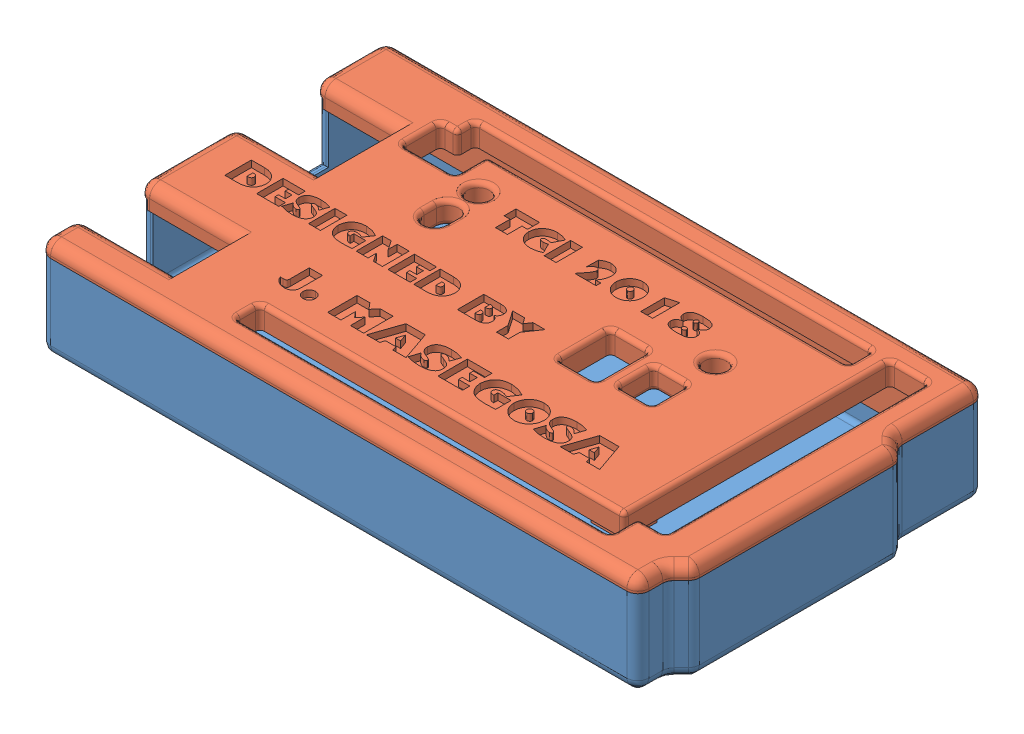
SolidWorks assembly Carcasa_V03.SLDASM, configuration Default (file format 11000). Lengths in mm.
Overall size (111.17 18.15 62.94).
2 component instances, 2 part files, 7 mates.
Components (placement in the parent):
- Tapadera Inferior_V03-1: Tapadera Inferior_V03.SLDPRT [Default] at (47.2941 45.9528 69.5797) size (111.17 15.71 62.94)
- Tapadera Superior_V03-1: Tapadera Superior_V03.SLDPRT [Default] at (47.2941 60.0628 69.5797) size (111.17 10.44 62.94)
Mates (geometry in assembly coordinates):
- Parallel1: parallel: plane of assembly; plane of assembly; plane of Tapadera Inferior_V03-1 through (123.5406 61.6628 57.7738) normal (1 0 0); plane of Tapadera Superior_V03-1 through (123.5406 64.0628 57.7738) normal (1 0 0)
- Parallel2: parallel: plane of assembly; plane of assembly; plane of Tapadera Inferior_V03-1 through (12.3752 61.6628 102.4466) normal (0 0 1); plane of Tapadera Superior_V03-1 through (12.3752 64.0628 102.4466) normal (0 0 1)
- Parallel3: parallel: plane of assembly; plane of assembly; plane of Tapadera Inferior_V03-1 through (12.3752 61.6628 39.5066) normal (0 0 -1); plane of Tapadera Superior_V03-1 through (12.3752 64.0628 39.5066) normal (0 0 -1)
- Parallel4: parallel: plane of assembly; plane of assembly; plane of Tapadera Inferior_V03-1 through (12.3752 61.6628 39.5066) normal (-1 0 0); plane of Tapadera Superior_V03-1 through (12.3752 64.0628 39.5066) normal (-1 0 0)
- Width3: width: plane of assembly; plane of assembly; plane of assembly; plane of assembly; plane of Tapadera Inferior_V03-1 through (12.3752 61.6628 39.5066) normal (-1 0 0); plane of Tapadera Inferior_V03-1 through (123.5406 61.6628 57.7738) normal (1 0 0); plane of Tapadera Superior_V03-1 through (12.3752 64.0628 39.5066) normal (-1 0 0); plane of Tapadera Superior_V03-1 through (123.5406 64.0628 57.7738) normal (1 0 0)
- Width4: width: plane of assembly; plane of assembly; plane of assembly; plane of assembly; plane of Tapadera Inferior_V03-1 through (12.3752 61.6628 39.5066) normal (0 0 -1); plane of Tapadera Inferior_V03-1 through (12.3752 61.6628 102.4466) normal (0 0 1); plane of Tapadera Superior_V03-1 through (12.3752 64.0628 102.4466) normal (0 0 1); plane of Tapadera Superior_V03-1 through (12.3752 64.0628 39.5066) normal (0 0 -1)
- Coincident10: coincident: plane of assembly; plane of assembly; plane of Tapadera Inferior_V03-1 through (47.2941 61.6628 69.5797) normal (0 1 0); plane of Tapadera Superior_V03-1 through (47.2941 61.6628 69.5797) normal (0 -1 0)
